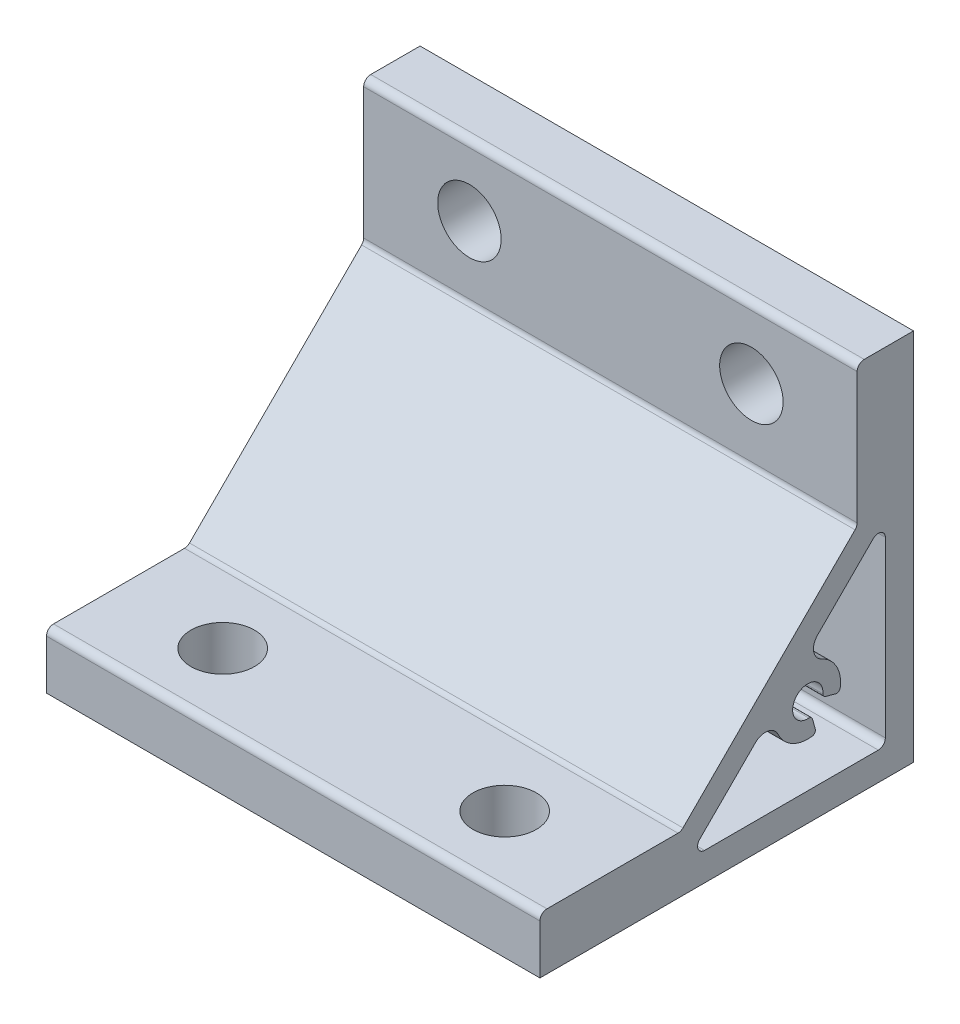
from build123d import *

# Parameters (mm, degrees)
EXTRUDE_1_DEPTH                 = 35
HOLE_WIZARD_9_0_9_1_D           = 9
HOLE_WIZARD_9_0_9_1_ON_FACE_2_D = 9


with BuildPart() as part:
    # Sketch 1 → Extrude 1 (new, symmetric)
    with BuildSketch(Plane(origin=(0, 0, 0), x_dir=(0, 0, -1), z_dir=(1, 0, 0))):
        with BuildLine():
            Line((-53, 0), (0, 0))
            Line((0, 0), (0, 53))
            Line((0, 53), (-7, 53))
            ThreePointArc((-7, 53), (-7.707106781, 52.707106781), (-8, 52))
            Line((-8, 52), (-8, 33.414213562))
            ThreePointArc((-8, 33.414213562), (-8.076120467, 33.03153013), (-8.292893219, 32.707106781))
            Line((-8.292893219, 32.707106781), (-32.707106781, 8.292893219))
            ThreePointArc((-32.707106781, 8.292893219), (-33.03153013, 8.076120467), (-33.414213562, 8))
            Line((-33.414213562, 8), (-52, 8))
            ThreePointArc((-52, 8), (-52.707106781, 7.707106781), (-53, 7))
            Line((-53, 7), (-53, 0))
        make_face()
        with BuildLine():
            Line((-5.707106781, 30.343145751), (-13.607410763, 22.442841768))
            ThreePointArc((-13.607410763, 22.442841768), (-14.162708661, 20.680742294), (-13.037348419, 19.215506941))
            ThreePointArc((-13.037348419, 19.215506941), (-10.912614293, 17.217155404), (-10.396162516, 14.346409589))
            ThreePointArc((-10.396162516, 14.346409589), (-10.615521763, 13.999552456), (-11.020608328, 13.933725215))
            Line((-11.020608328, 13.933725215), (-12.486271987, 14.326448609))
            ThreePointArc((-12.486271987, 14.326448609), (-12.764234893, 14.519501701), (-12.85556766, 14.845371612))
            ThreePointArc((-12.85556766, 14.845371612), (-16.52027958, 16.52027958), (-14.845371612, 12.85556766))
            ThreePointArc((-14.845371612, 12.85556766), (-14.519501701, 12.764234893), (-14.326448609, 12.486271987))
            Line((-14.326448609, 12.486271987), (-13.933725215, 11.020608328))
            ThreePointArc((-13.933725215, 11.020608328), (-13.999552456, 10.615521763), (-14.346409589, 10.396162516))
            ThreePointArc((-14.346409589, 10.396162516), (-17.217155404, 10.912614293), (-19.215506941, 13.037348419))
            ThreePointArc((-19.215506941, 13.037348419), (-20.680742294, 14.162708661), (-22.442841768, 13.607410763))
            Line((-22.442841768, 13.607410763), (-30.343145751, 5.707106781))
            ThreePointArc((-30.343145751, 5.707106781), (-30.559918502, 4.617316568), (-29.636038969, 4))
            Line((-29.636038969, 4), (-5, 4))
            ThreePointArc((-5, 4), (-4.292893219, 4.292893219), (-4, 5))
            Line((-4, 5), (-4, 29.636038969))
            ThreePointArc((-4, 29.636038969), (-4.617316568, 30.559918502), (-5.707106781, 30.343145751))
        make_face(mode=Mode.SUBTRACT)
    extrude(amount=EXTRUDE_1_DEPTH, both=True)

    # Hole Wizard 9.0 _9_ _1 (through all)
    with Locations(Plane(origin=(-20, 8, 43), x_dir=(0, 0, 1), z_dir=(0, 1, 0))):
        with Locations((0, 0), (0, 40)):
            Hole(HOLE_WIZARD_9_0_9_1_D / 2)

    # Hole Wizard 9.0 _9_ _1 on face 2 (through all)
    with Locations(Plane(origin=(-20, 43, 8), x_dir=(1, 0, 0), z_dir=(0, 0, 1))):
        with Locations((0, 0), (40, 0)):
            Hole(HOLE_WIZARD_9_0_9_1_ON_FACE_2_D / 2)


solid = part.part
